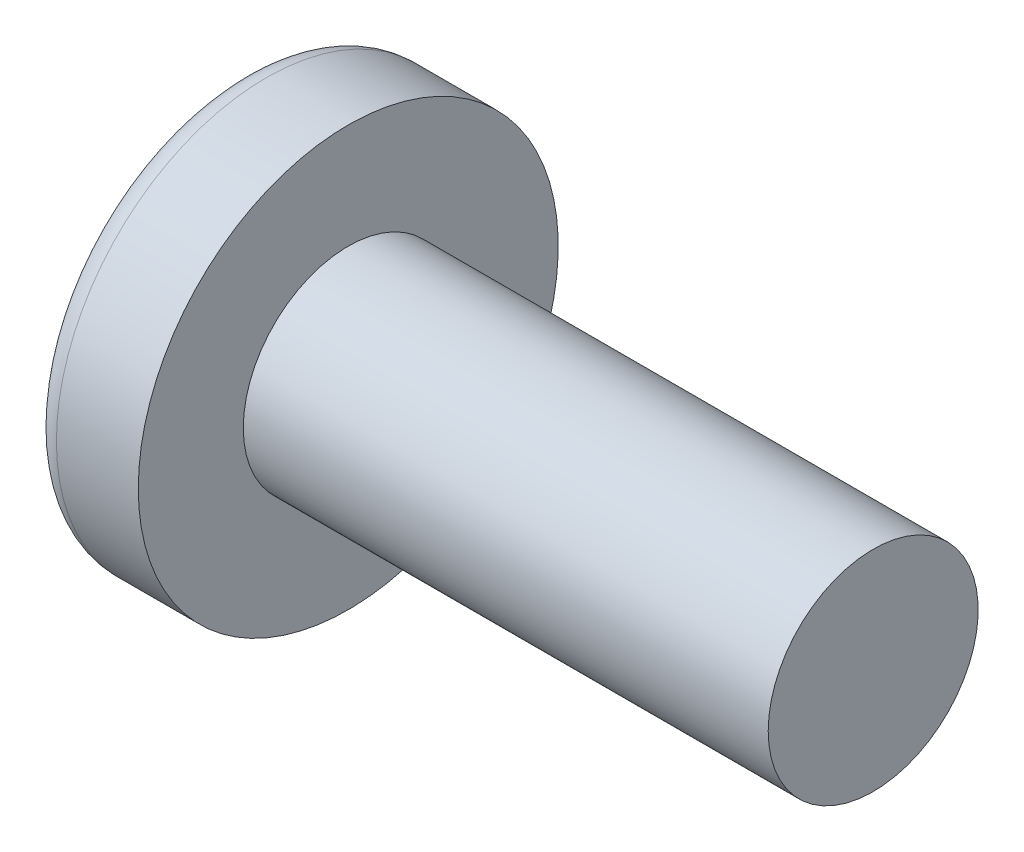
from build123d import *

# Parameters (mm, degrees)
CIRPATTERN1_COUNT = 2
CIRPATTERN1_ANGLE = 90


with BuildPart() as part:
    # BodySke → Base-Revolve (revolve)
    with BuildSketch(Plane.XY, mode=Mode.PRIVATE) as base_revolve_sk:
        with BuildLine():
            Line((1.6, 1), (1.6, 2))
            Line((1.6, 2), (0.820084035, 2))
            ThreePointArc((0.820084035, 2), (0.712029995, 1.974299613), (0.627117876, 1.902702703))
            ThreePointArc((0.627117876, 1.902702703), (0.160820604, 1.001692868), (0, 0))
            Line((0, 0), (6.6, 0))
            Line((6.6, 0), (6.6, 1))
            Line((6.6, 1), (1.6, 1))
        make_face()
    revolve(base_revolve_sk.sketch.rotate(Axis((-25.4, 0, 0), (1, 0, 0)), 90), axis=Axis((-25.4, 0, 0), (1, 0, 0)))

    # Sketch3 → Cut-Loft1 section 0
    with BuildSketch(Plane(origin=(0, 0, 0), x_dir=(0, 0, -1), z_dir=(1, 0, 0))):
        with BuildLine():
            Line((0.24, -0.91), (-0.24, -0.91))
            Line((-0.24, -0.91), (-0.24, 0.91))
            Line((-0.24, 0.91), (0.24, 0.91))
            Line((0.24, 0.91), (0.24, -0.91))
        make_face()
    # Sketch4 → Cut-Loft1 section 1
    with BuildSketch(Plane(origin=(1.19, 0, 0), x_dir=(0, 0, -1), z_dir=(1, 0, 0))):
        with BuildLine():
            Line((0.12, -0.12), (-0.12, -0.12))
            Line((-0.12, -0.12), (-0.12, 0.12))
            Line((-0.12, 0.12), (0.12, 0.12))
            Line((0.12, 0.12), (0.12, -0.12))
        make_face()
    cut_loft1 = loft(mode=Mode.SUBTRACT)

    # CirPattern1: Cut-Loft1 ×2 about axis
    cirpattern1_axis = Axis((0, 0, 0), (1, 0, 0))
    for i in range(1, CIRPATTERN1_COUNT):
        add(cut_loft1.rotate(cirpattern1_axis, i * CIRPATTERN1_ANGLE / (CIRPATTERN1_COUNT - 1)), mode=Mode.SUBTRACT)


solid = part.part
